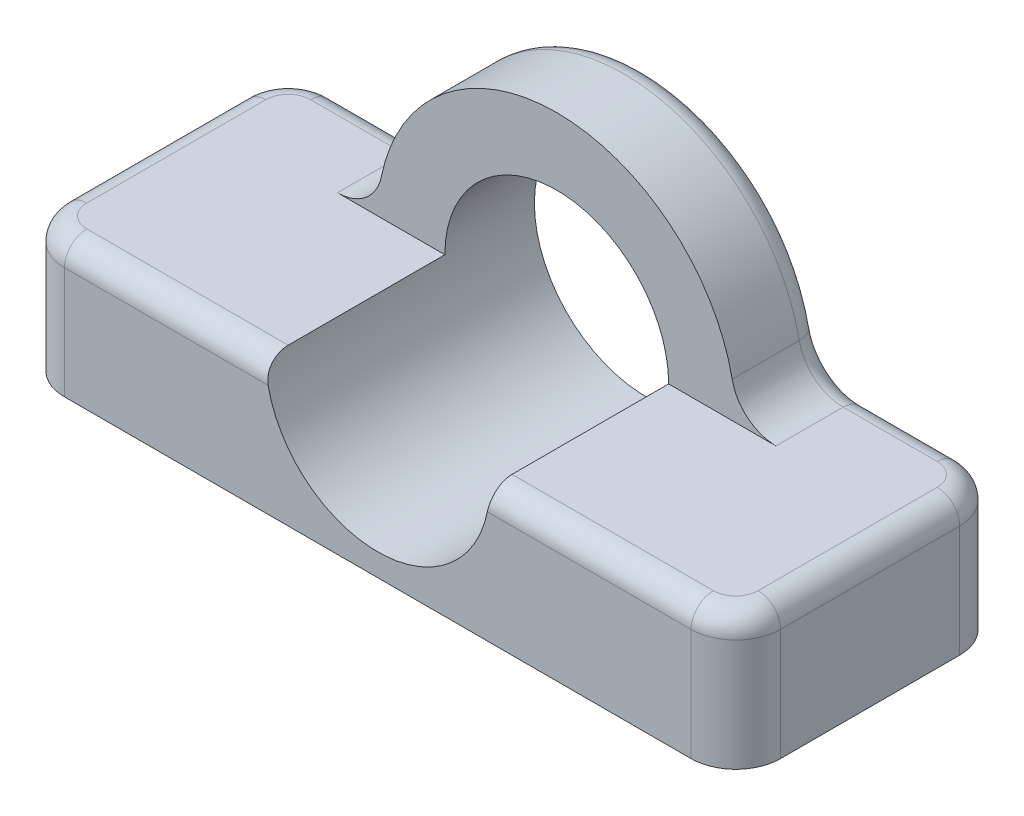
ISO-10303-21;
HEADER;
FILE_DESCRIPTION(('STEP AP214'),'2;1');
FILE_NAME('part.step','',(''),(''),'','','');
FILE_SCHEMA(('AUTOMOTIVE_DESIGN { 1 0 10303 214 1 1 1 1 }'));
ENDSEC;
DATA;
#1=APPLICATION_CONTEXT('core data for automotive mechanical design processes');
#2=APPLICATION_PROTOCOL_DEFINITION('international standard','automotive_design',2000,#1);
#3=PRODUCT_CONTEXT('',#1,'mechanical');
#4=PRODUCT('Part','Part','',(#3));
#5=PRODUCT_RELATED_PRODUCT_CATEGORY('part','',(#4));
#6=PRODUCT_DEFINITION_FORMATION('','',#4);
#7=PRODUCT_DEFINITION_CONTEXT('part definition',#1,'design');
#8=PRODUCT_DEFINITION('design','',#6,#7);
#9=PRODUCT_DEFINITION_SHAPE('','',#8);
#10=(LENGTH_UNIT() NAMED_UNIT(*) SI_UNIT(.MILLI.,.METRE.));
#11=(NAMED_UNIT(*) PLANE_ANGLE_UNIT() SI_UNIT($,.RADIAN.));
#12=(NAMED_UNIT(*) SI_UNIT($,.STERADIAN.) SOLID_ANGLE_UNIT());
#13=UNCERTAINTY_MEASURE_WITH_UNIT(LENGTH_MEASURE(1.E-05),#10,'distance_accuracy_value','');
#14=(GEOMETRIC_REPRESENTATION_CONTEXT(3) GLOBAL_UNCERTAINTY_ASSIGNED_CONTEXT((#13)) GLOBAL_UNIT_ASSIGNED_CONTEXT((#10,
#11,#12)) REPRESENTATION_CONTEXT('',''));
#15=CARTESIAN_POINT('',(0.,0.,0.));
#16=DIRECTION('',(0.,0.,1.));
#17=DIRECTION('',(1.,0.,0.));
#18=AXIS2_PLACEMENT_3D('',#15,#16,#17);
#19=CARTESIAN_POINT('',(0.,19.05,-38.1));
#20=DIRECTION('',(0.,-1.,0.));
#21=DIRECTION('',(0.,0.,-1.));
#22=AXIS2_PLACEMENT_3D('',#19,#20,#21);
#23=PLANE('',#22);
#24=DIRECTION('',(0.,0.,-1.));
#25=VECTOR('',#24,1.);
#26=CARTESIAN_POINT('',(19.6914802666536,19.05,-38.1));
#27=LINE('',#26,#25);
#28=CARTESIAN_POINT('',(19.6914802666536,19.05,-25.4));
#29=VERTEX_POINT('',#28);
#30=CARTESIAN_POINT('',(19.6914802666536,19.05,-34.925));
#31=VERTEX_POINT('',#30);
#32=EDGE_CURVE('E219',#29,#31,#27,.T.);
#33=ORIENTED_EDGE('',*,*,#32,.T.);
#34=DIRECTION('',(-1.,0.,0.));
#35=VECTOR('',#34,1.);
#36=CARTESIAN_POINT('',(0.,19.05,-34.925));
#37=LINE('',#36,#35);
#38=CARTESIAN_POINT('',(6.35,19.05,-34.925));
#39=VERTEX_POINT('',#38);
#40=EDGE_CURVE('E538',#31,#39,#37,.T.);
#41=ORIENTED_EDGE('',*,*,#40,.T.);
#42=CARTESIAN_POINT('',(6.35,19.05,-31.75));
#43=DIRECTION('',(0.,-1.,0.));
#44=DIRECTION('',(0.,0.,-1.));
#45=AXIS2_PLACEMENT_3D('',#42,#43,#44);
#46=CIRCLE('',#45,3.175);
#47=CARTESIAN_POINT('',(3.175,19.05,-31.75));
#48=VERTEX_POINT('',#47);
#49=EDGE_CURVE('E536',#39,#48,#46,.F.);
#50=ORIENTED_EDGE('',*,*,#49,.T.);
#51=DIRECTION('',(0.,0.,1.));
#52=VECTOR('',#51,1.);
#53=CARTESIAN_POINT('',(3.175,19.05,-38.1));
#54=LINE('',#53,#52);
#55=CARTESIAN_POINT('',(3.175,19.05,-6.35));
#56=VERTEX_POINT('',#55);
#57=EDGE_CURVE('E534',#48,#56,#54,.T.);
#58=ORIENTED_EDGE('',*,*,#57,.T.);
#59=CARTESIAN_POINT('',(6.35,19.05,-6.35));
#60=DIRECTION('',(0.,-1.,0.));
#61=DIRECTION('',(0.,0.,-1.));
#62=AXIS2_PLACEMENT_3D('',#59,#60,#61);
#63=CIRCLE('',#62,3.175);
#64=CARTESIAN_POINT('',(6.35,19.05,-3.175));
#65=VERTEX_POINT('',#64);
#66=EDGE_CURVE('E532',#56,#65,#63,.F.);
#67=ORIENTED_EDGE('',*,*,#66,.T.);
#68=DIRECTION('',(1.,0.,0.));
#69=VECTOR('',#68,1.);
#70=CARTESIAN_POINT('',(0.,19.05,-3.175));
#71=LINE('',#70,#69);
#72=CARTESIAN_POINT('',(34.925,19.05,-3.175));
#73=VERTEX_POINT('',#72);
#74=EDGE_CURVE('E176',#65,#73,#71,.T.);
#75=ORIENTED_EDGE('',*,*,#74,.T.);
#76=DIRECTION('',(0.,0.,-1.));
#77=VECTOR('',#76,1.);
#78=CARTESIAN_POINT('',(34.925,19.05,0.));
#79=LINE('',#78,#77);
#80=CARTESIAN_POINT('',(34.925,19.05,-25.4));
#81=VERTEX_POINT('',#80);
#82=EDGE_CURVE('E169',#73,#81,#79,.T.);
#83=ORIENTED_EDGE('',*,*,#82,.T.);
#84=DIRECTION('',(-1.,0.,0.));
#85=VECTOR('',#84,1.);
#86=CARTESIAN_POINT('',(25.4,19.05,-25.4));
#87=LINE('',#86,#85);
#88=EDGE_CURVE('E173',#81,#29,#87,.T.);
#89=ORIENTED_EDGE('',*,*,#88,.T.);
#90=EDGE_LOOP('',(#33,#41,#50,#58,#67,#75,#83,#89));
#91=FACE_BOUND('',#90,.T.);
#92=ADVANCED_FACE('F28',(#91),#23,.F.);
#93=CARTESIAN_POINT('',(0.,19.05,0.));
#94=DIRECTION('',(1.,0.,0.));
#95=DIRECTION('',(0.,0.,-1.));
#96=AXIS2_PLACEMENT_3D('',#93,#94,#95);
#97=PLANE('',#96);
#98=DIRECTION('',(0.,-1.,0.));
#99=VECTOR('',#98,1.);
#100=CARTESIAN_POINT('',(0.,19.05,-6.35));
#101=LINE('',#100,#99);
#102=CARTESIAN_POINT('',(0.,0.,-6.35));
#103=VERTEX_POINT('',#102);
#104=CARTESIAN_POINT('',(0.,15.875,-6.35));
#105=VERTEX_POINT('',#104);
#106=EDGE_CURVE('E248',#103,#105,#101,.F.);
#107=ORIENTED_EDGE('',*,*,#106,.T.);
#108=DIRECTION('',(0.,0.,1.));
#109=VECTOR('',#108,1.);
#110=CARTESIAN_POINT('',(0.,15.875,0.));
#111=LINE('',#110,#109);
#112=CARTESIAN_POINT('',(0.,15.875,-31.75));
#113=VERTEX_POINT('',#112);
#114=EDGE_CURVE('E36',#105,#113,#111,.F.);
#115=ORIENTED_EDGE('',*,*,#114,.T.);
#116=DIRECTION('',(0.,-1.,0.));
#117=VECTOR('',#116,1.);
#118=CARTESIAN_POINT('',(0.,19.05,-31.75));
#119=LINE('',#118,#117);
#120=CARTESIAN_POINT('',(0.,0.,-31.75));
#121=VERTEX_POINT('',#120);
#122=EDGE_CURVE('E250',#113,#121,#119,.T.);
#123=ORIENTED_EDGE('',*,*,#122,.T.);
#124=DIRECTION('',(0.,0.,1.));
#125=VECTOR('',#124,1.);
#126=CARTESIAN_POINT('',(0.,0.,0.));
#127=LINE('',#126,#125);
#128=EDGE_CURVE('E199',#121,#103,#127,.T.);
#129=ORIENTED_EDGE('',*,*,#128,.T.);
#130=EDGE_LOOP('',(#107,#115,#123,#129));
#131=FACE_BOUND('',#130,.T.);
#132=ADVANCED_FACE('F30',(#131),#97,.F.);
#133=CARTESIAN_POINT('',(0.,19.05,0.));
#134=DIRECTION('',(0.,0.,-1.));
#135=DIRECTION('',(-1.,0.,0.));
#136=AXIS2_PLACEMENT_3D('',#133,#134,#135);
#137=PLANE('',#136);
#138=DIRECTION('',(0.,-1.,0.));
#139=VECTOR('',#138,1.);
#140=CARTESIAN_POINT('',(95.25,19.05,0.));
#141=LINE('',#140,#139);
#142=CARTESIAN_POINT('',(95.25,0.,0.));
#143=VERTEX_POINT('',#142);
#144=CARTESIAN_POINT('',(95.25,15.875,0.));
#145=VERTEX_POINT('',#144);
#146=EDGE_CURVE('E240',#143,#145,#141,.F.);
#147=ORIENTED_EDGE('',*,*,#146,.T.);
#148=DIRECTION('',(1.,0.,0.));
#149=VECTOR('',#148,1.);
#150=CARTESIAN_POINT('',(0.,15.875,0.));
#151=LINE('',#150,#149);
#152=CARTESIAN_POINT('',(66.3542598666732,15.875,0.));
#153=VERTEX_POINT('',#152);
#154=EDGE_CURVE('E265',#145,#153,#151,.F.);
#155=ORIENTED_EDGE('',*,*,#154,.T.);
#156=CARTESIAN_POINT('',(50.8,19.05,0.));
#157=DIRECTION('',(0.,0.,-1.));
#158=DIRECTION('',(-1.,0.,0.));
#159=AXIS2_PLACEMENT_3D('',#156,#157,#158);
#160=CIRCLE('',#159,15.875);
#161=CARTESIAN_POINT('',(35.2457401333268,15.875,0.));
#162=VERTEX_POINT('',#161);
#163=EDGE_CURVE('E619',#153,#162,#160,.T.);
#164=ORIENTED_EDGE('',*,*,#163,.T.);
#165=DIRECTION('',(1.,0.,0.));
#166=VECTOR('',#165,1.);
#167=CARTESIAN_POINT('',(0.,15.875,0.));
#168=LINE('',#167,#166);
#169=CARTESIAN_POINT('',(6.35,15.875,0.));
#170=VERTEX_POINT('',#169);
#171=EDGE_CURVE('E263',#162,#170,#168,.F.);
#172=ORIENTED_EDGE('',*,*,#171,.T.);
#173=DIRECTION('',(0.,-1.,0.));
#174=VECTOR('',#173,1.);
#175=CARTESIAN_POINT('',(6.35,19.05,0.));
#176=LINE('',#175,#174);
#177=CARTESIAN_POINT('',(6.35,0.,0.));
#178=VERTEX_POINT('',#177);
#179=EDGE_CURVE('E238',#170,#178,#176,.T.);
#180=ORIENTED_EDGE('',*,*,#179,.T.);
#181=DIRECTION('',(1.,0.,0.));
#182=VECTOR('',#181,1.);
#183=CARTESIAN_POINT('',(0.,0.,0.));
#184=LINE('',#183,#182);
#185=EDGE_CURVE('E205',#178,#143,#184,.T.);
#186=ORIENTED_EDGE('',*,*,#185,.T.);
#187=EDGE_LOOP('',(#147,#155,#164,#172,#180,#186));
#188=FACE_BOUND('',#187,.T.);
#189=ADVANCED_FACE('F320',(#188),#137,.F.);
#190=CARTESIAN_POINT('',(101.6,19.05,0.));
#191=DIRECTION('',(-1.,0.,0.));
#192=DIRECTION('',(0.,0.,1.));
#193=AXIS2_PLACEMENT_3D('',#190,#191,#192);
#194=PLANE('',#193);
#195=DIRECTION('',(0.,-1.,0.));
#196=VECTOR('',#195,1.);
#197=CARTESIAN_POINT('',(101.6,19.05,-31.75));
#198=LINE('',#197,#196);
#199=CARTESIAN_POINT('',(101.6,0.,-31.75));
#200=VERTEX_POINT('',#199);
#201=CARTESIAN_POINT('',(101.6,15.875,-31.75));
#202=VERTEX_POINT('',#201);
#203=EDGE_CURVE('E190',#200,#202,#198,.F.);
#204=ORIENTED_EDGE('',*,*,#203,.T.);
#205=DIRECTION('',(0.,0.,-1.));
#206=VECTOR('',#205,1.);
#207=CARTESIAN_POINT('',(101.6,15.875,0.));
#208=LINE('',#207,#206);
#209=CARTESIAN_POINT('',(101.6,15.875,-6.35));
#210=VERTEX_POINT('',#209);
#211=EDGE_CURVE('E507',#202,#210,#208,.F.);
#212=ORIENTED_EDGE('',*,*,#211,.T.);
#213=DIRECTION('',(0.,-1.,0.));
#214=VECTOR('',#213,1.);
#215=CARTESIAN_POINT('',(101.6,19.05,-6.35));
#216=LINE('',#215,#214);
#217=CARTESIAN_POINT('',(101.6,0.,-6.35));
#218=VERTEX_POINT('',#217);
#219=EDGE_CURVE('E228',#210,#218,#216,.T.);
#220=ORIENTED_EDGE('',*,*,#219,.T.);
#221=DIRECTION('',(0.,0.,-1.));
#222=VECTOR('',#221,1.);
#223=CARTESIAN_POINT('',(101.6,0.,0.));
#224=LINE('',#223,#222);
#225=EDGE_CURVE('E208',#218,#200,#224,.T.);
#226=ORIENTED_EDGE('',*,*,#225,.T.);
#227=EDGE_LOOP('',(#204,#212,#220,#226));
#228=FACE_BOUND('',#227,.T.);
#229=ADVANCED_FACE('F317',(#228),#194,.F.);
#230=CARTESIAN_POINT('',(0.,19.05,-38.1));
#231=DIRECTION('',(0.,0.,1.));
#232=DIRECTION('',(1.,0.,0.));
#233=AXIS2_PLACEMENT_3D('',#230,#231,#232);
#234=PLANE('',#233);
#235=CARTESIAN_POINT('',(50.8,19.05,-38.1));
#236=DIRECTION('',(0.,0.,-1.));
#237=DIRECTION('',(-1.,0.,0.));
#238=AXIS2_PLACEMENT_3D('',#235,#236,#237);
#239=CIRCLE('',#238,15.875);
#240=CARTESIAN_POINT('',(34.925,19.05,-38.1));
#241=VERTEX_POINT('',#240);
#242=EDGE_CURVE('E616',#241,#241,#239,.T.);
#243=ORIENTED_EDGE('',*,*,#242,.F.);
#244=EDGE_LOOP('',(#243));
#245=FACE_BOUND('',#244,.T.);
#246=CARTESIAN_POINT('',(81.9085197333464,25.4,-38.1));
#247=DIRECTION('',(0.,0.,1.));
#248=DIRECTION('',(1.,0.,0.));
#249=AXIS2_PLACEMENT_3D('',#246,#247,#248);
#250=CIRCLE('',#249,9.525);
#251=CARTESIAN_POINT('',(72.5759638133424,23.495,-38.1));
#252=VERTEX_POINT('',#251);
#253=CARTESIAN_POINT('',(81.9085197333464,15.875,-38.1));
#254=VERTEX_POINT('',#253);
#255=EDGE_CURVE('E521',#252,#254,#250,.T.);
#256=ORIENTED_EDGE('',*,*,#255,.T.);
#257=DIRECTION('',(-1.,0.,0.));
#258=VECTOR('',#257,1.);
#259=CARTESIAN_POINT('',(0.,15.875,-38.1));
#260=LINE('',#259,#258);
#261=CARTESIAN_POINT('',(95.25,15.875,-38.1));
#262=VERTEX_POINT('',#261);
#263=EDGE_CURVE('E523',#254,#262,#260,.F.);
#264=ORIENTED_EDGE('',*,*,#263,.T.);
#265=DIRECTION('',(0.,-1.,0.));
#266=VECTOR('',#265,1.);
#267=CARTESIAN_POINT('',(95.25,19.05,-38.1));
#268=LINE('',#267,#266);
#269=CARTESIAN_POINT('',(95.25,0.,-38.1));
#270=VERTEX_POINT('',#269);
#271=EDGE_CURVE('E246',#262,#270,#268,.T.);
#272=ORIENTED_EDGE('',*,*,#271,.T.);
#273=DIRECTION('',(-1.,0.,0.));
#274=VECTOR('',#273,1.);
#275=CARTESIAN_POINT('',(0.,0.,-38.1));
#276=LINE('',#275,#274);
#277=CARTESIAN_POINT('',(6.35,0.,-38.1));
#278=VERTEX_POINT('',#277);
#279=EDGE_CURVE('E211',#270,#278,#276,.T.);
#280=ORIENTED_EDGE('',*,*,#279,.T.);
#281=DIRECTION('',(0.,-1.,0.));
#282=VECTOR('',#281,1.);
#283=CARTESIAN_POINT('',(6.35,19.05,-38.1));
#284=LINE('',#283,#282);
#285=CARTESIAN_POINT('',(6.35,15.875,-38.1));
#286=VERTEX_POINT('',#285);
#287=EDGE_CURVE('E243',#278,#286,#284,.F.);
#288=ORIENTED_EDGE('',*,*,#287,.T.);
#289=DIRECTION('',(-1.,0.,0.));
#290=VECTOR('',#289,1.);
#291=CARTESIAN_POINT('',(0.,15.875,-38.1));
#292=LINE('',#291,#290);
#293=CARTESIAN_POINT('',(19.6914802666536,15.875,-38.1));
#294=VERTEX_POINT('',#293);
#295=EDGE_CURVE('E515',#286,#294,#292,.F.);
#296=ORIENTED_EDGE('',*,*,#295,.T.);
#297=CARTESIAN_POINT('',(19.6914802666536,25.4,-38.1));
#298=DIRECTION('',(0.,0.,1.));
#299=DIRECTION('',(1.,0.,0.));
#300=AXIS2_PLACEMENT_3D('',#297,#298,#299);
#301=CIRCLE('',#300,9.525);
#302=CARTESIAN_POINT('',(29.0240361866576,23.495,-38.1));
#303=VERTEX_POINT('',#302);
#304=EDGE_CURVE('E517',#294,#303,#301,.T.);
#305=ORIENTED_EDGE('',*,*,#304,.T.);
#306=CARTESIAN_POINT('',(50.8,19.05,-38.1));
#307=DIRECTION('',(0.,0.,1.));
#308=DIRECTION('',(1.,0.,0.));
#309=AXIS2_PLACEMENT_3D('',#306,#307,#308);
#310=CIRCLE('',#309,22.225);
#311=EDGE_CURVE('E519',#303,#252,#310,.F.);
#312=ORIENTED_EDGE('',*,*,#311,.T.);
#313=EDGE_LOOP('',(#256,#264,#272,#280,#288,#296,#305,#312));
#314=FACE_BOUND('',#313,.T.);
#315=ADVANCED_FACE('F313',(#245,#314),#234,.F.);
#316=DIRECTION('',(0.,0.,-1.));
#317=VECTOR('',#316,1.);
#318=CARTESIAN_POINT('',(66.675,19.05,0.));
#319=LINE('',#318,#317);
#320=CARTESIAN_POINT('',(66.675,19.05,-25.4));
#321=VERTEX_POINT('',#320);
#322=CARTESIAN_POINT('',(66.675,19.05,-3.175));
#323=VERTEX_POINT('',#322);
#324=EDGE_CURVE('E180',#321,#323,#319,.F.);
#325=ORIENTED_EDGE('',*,*,#324,.T.);
#326=DIRECTION('',(1.,0.,0.));
#327=VECTOR('',#326,1.);
#328=CARTESIAN_POINT('',(0.,19.05,-3.175));
#329=LINE('',#328,#327);
#330=CARTESIAN_POINT('',(95.25,19.05,-3.175));
#331=VERTEX_POINT('',#330);
#332=EDGE_CURVE('E260',#323,#331,#329,.T.);
#333=ORIENTED_EDGE('',*,*,#332,.T.);
#334=CARTESIAN_POINT('',(95.25,19.05,-6.35));
#335=DIRECTION('',(0.,-1.,0.));
#336=DIRECTION('',(0.,0.,-1.));
#337=AXIS2_PLACEMENT_3D('',#334,#335,#336);
#338=CIRCLE('',#337,3.175);
#339=CARTESIAN_POINT('',(98.425,19.05,-6.35));
#340=VERTEX_POINT('',#339);
#341=EDGE_CURVE('E258',#331,#340,#338,.F.);
#342=ORIENTED_EDGE('',*,*,#341,.T.);
#343=DIRECTION('',(0.,0.,-1.));
#344=VECTOR('',#343,1.);
#345=CARTESIAN_POINT('',(98.425,19.05,-38.1));
#346=LINE('',#345,#344);
#347=CARTESIAN_POINT('',(98.425,19.05,-31.75));
#348=VERTEX_POINT('',#347);
#349=EDGE_CURVE('E256',#340,#348,#346,.T.);
#350=ORIENTED_EDGE('',*,*,#349,.T.);
#351=CARTESIAN_POINT('',(95.25,19.05,-31.75));
#352=DIRECTION('',(0.,-1.,0.));
#353=DIRECTION('',(0.,0.,-1.));
#354=AXIS2_PLACEMENT_3D('',#351,#352,#353);
#355=CIRCLE('',#354,3.175);
#356=CARTESIAN_POINT('',(95.25,19.05,-34.925));
#357=VERTEX_POINT('',#356);
#358=EDGE_CURVE('E254',#348,#357,#355,.F.);
#359=ORIENTED_EDGE('',*,*,#358,.T.);
#360=DIRECTION('',(-1.,0.,0.));
#361=VECTOR('',#360,1.);
#362=CARTESIAN_POINT('',(0.,19.05,-34.925));
#363=LINE('',#362,#361);
#364=CARTESIAN_POINT('',(81.9085197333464,19.05,-34.925));
#365=VERTEX_POINT('',#364);
#366=EDGE_CURVE('E252',#357,#365,#363,.T.);
#367=ORIENTED_EDGE('',*,*,#366,.T.);
#368=DIRECTION('',(0.,0.,-1.));
#369=VECTOR('',#368,1.);
#370=CARTESIAN_POINT('',(81.9085197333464,19.05,-38.1));
#371=LINE('',#370,#369);
#372=CARTESIAN_POINT('',(81.9085197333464,19.05,-25.4));
#373=VERTEX_POINT('',#372);
#374=EDGE_CURVE('E221',#365,#373,#371,.F.);
#375=ORIENTED_EDGE('',*,*,#374,.T.);
#376=EDGE_CURVE('E197',#373,#321,#87,.T.);
#377=ORIENTED_EDGE('',*,*,#376,.T.);
#378=EDGE_LOOP('',(#325,#333,#342,#350,#359,#367,#375,#377));
#379=FACE_BOUND('',#378,.T.);
#380=ADVANCED_FACE('F309',(#379),#23,.F.);
#381=CARTESIAN_POINT('',(0.,0.,-38.1));
#382=DIRECTION('',(0.,-1.,0.));
#383=DIRECTION('',(0.,0.,-1.));
#384=AXIS2_PLACEMENT_3D('',#381,#382,#383);
#385=PLANE('',#384);
#386=ORIENTED_EDGE('',*,*,#225,.F.);
#387=CARTESIAN_POINT('',(95.25,0.,-6.35));
#388=DIRECTION('',(0.,-1.,0.));
#389=DIRECTION('',(0.,0.,-1.));
#390=AXIS2_PLACEMENT_3D('',#387,#388,#389);
#391=CIRCLE('',#390,6.35);
#392=EDGE_CURVE('E236',#218,#143,#391,.T.);
#393=ORIENTED_EDGE('',*,*,#392,.T.);
#394=ORIENTED_EDGE('',*,*,#185,.F.);
#395=CARTESIAN_POINT('',(6.35,0.,-6.35));
#396=DIRECTION('',(0.,-1.,0.));
#397=DIRECTION('',(0.,0.,-1.));
#398=AXIS2_PLACEMENT_3D('',#395,#396,#397);
#399=CIRCLE('',#398,6.35);
#400=EDGE_CURVE('E230',#178,#103,#399,.T.);
#401=ORIENTED_EDGE('',*,*,#400,.T.);
#402=ORIENTED_EDGE('',*,*,#128,.F.);
#403=CARTESIAN_POINT('',(6.35,0.,-31.75));
#404=DIRECTION('',(0.,-1.,0.));
#405=DIRECTION('',(0.,0.,-1.));
#406=AXIS2_PLACEMENT_3D('',#403,#404,#405);
#407=CIRCLE('',#406,6.35);
#408=EDGE_CURVE('E232',#121,#278,#407,.T.);
#409=ORIENTED_EDGE('',*,*,#408,.T.);
#410=ORIENTED_EDGE('',*,*,#279,.F.);
#411=CARTESIAN_POINT('',(95.25,0.,-31.75));
#412=DIRECTION('',(0.,-1.,0.));
#413=DIRECTION('',(0.,0.,-1.));
#414=AXIS2_PLACEMENT_3D('',#411,#412,#413);
#415=CIRCLE('',#414,6.35);
#416=EDGE_CURVE('E234',#270,#200,#415,.T.);
#417=ORIENTED_EDGE('',*,*,#416,.T.);
#418=EDGE_LOOP('',(#386,#393,#394,#401,#402,#409,#410,#417));
#419=FACE_BOUND('',#418,.T.);
#420=ADVANCED_FACE('F305',(#419),#385,.T.);
#421=CARTESIAN_POINT('',(50.8,19.05,-25.4));
#422=DIRECTION('',(0.,0.,-1.));
#423=DIRECTION('',(-1.,0.,0.));
#424=AXIS2_PLACEMENT_3D('',#421,#422,#423);
#425=CYLINDRICAL_SURFACE('',#424,25.4);
#426=DIRECTION('',(0.,0.,-1.));
#427=VECTOR('',#426,1.);
#428=CARTESIAN_POINT('',(75.6868157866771,24.13,-25.4));
#429=LINE('',#428,#427);
#430=CARTESIAN_POINT('',(75.6868157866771,24.13,-25.4));
#431=VERTEX_POINT('',#430);
#432=CARTESIAN_POINT('',(75.6868157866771,24.13,-34.925));
#433=VERTEX_POINT('',#432);
#434=EDGE_CURVE('E216',#431,#433,#429,.T.);
#435=ORIENTED_EDGE('',*,*,#434,.T.);
#436=CARTESIAN_POINT('',(50.8,19.05,-34.925));
#437=DIRECTION('',(0.,0.,1.));
#438=DIRECTION('',(1.,0.,0.));
#439=AXIS2_PLACEMENT_3D('',#436,#437,#438);
#440=CIRCLE('',#439,25.4);
#441=CARTESIAN_POINT('',(25.9131842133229,24.13,-34.925));
#442=VERTEX_POINT('',#441);
#443=EDGE_CURVE('E527',#433,#442,#440,.T.);
#444=ORIENTED_EDGE('',*,*,#443,.T.);
#445=DIRECTION('',(0.,0.,-1.));
#446=VECTOR('',#445,1.);
#447=CARTESIAN_POINT('',(25.9131842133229,24.13,-25.4));
#448=LINE('',#447,#446);
#449=CARTESIAN_POINT('',(25.9131842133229,24.13,-25.4));
#450=VERTEX_POINT('',#449);
#451=EDGE_CURVE('E214',#442,#450,#448,.F.);
#452=ORIENTED_EDGE('',*,*,#451,.T.);
#453=CARTESIAN_POINT('',(50.8,19.05,-25.4));
#454=DIRECTION('',(0.,0.,-1.));
#455=DIRECTION('',(1.,0.,0.));
#456=AXIS2_PLACEMENT_3D('',#453,#454,#455);
#457=CIRCLE('',#456,25.4);
#458=EDGE_CURVE('E179',#450,#431,#457,.T.);
#459=ORIENTED_EDGE('',*,*,#458,.T.);
#460=EDGE_LOOP('',(#435,#444,#452,#459));
#461=FACE_BOUND('',#460,.T.);
#462=ADVANCED_FACE('F302',(#461),#425,.T.);
#463=CARTESIAN_POINT('',(50.8,19.05,-25.4));
#464=DIRECTION('',(0.,0.,1.));
#465=DIRECTION('',(1.,0.,0.));
#466=AXIS2_PLACEMENT_3D('',#463,#464,#465);
#467=PLANE('',#466);
#468=CARTESIAN_POINT('',(50.8,19.05,-25.4));
#469=DIRECTION('',(0.,0.,1.));
#470=DIRECTION('',(1.,0.,0.));
#471=AXIS2_PLACEMENT_3D('',#468,#469,#470);
#472=CIRCLE('',#471,15.875);
#473=EDGE_CURVE('E183',#321,#81,#472,.T.);
#474=ORIENTED_EDGE('',*,*,#473,.F.);
#475=ORIENTED_EDGE('',*,*,#376,.F.);
#476=CARTESIAN_POINT('',(81.9085197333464,25.4,-25.4));
#477=DIRECTION('',(0.,0.,1.));
#478=DIRECTION('',(1.,0.,0.));
#479=AXIS2_PLACEMENT_3D('',#476,#477,#478);
#480=CIRCLE('',#479,6.35);
#481=EDGE_CURVE('E223',#373,#431,#480,.F.);
#482=ORIENTED_EDGE('',*,*,#481,.T.);
#483=ORIENTED_EDGE('',*,*,#458,.F.);
#484=CARTESIAN_POINT('',(19.6914802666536,25.4,-25.4));
#485=DIRECTION('',(0.,0.,1.));
#486=DIRECTION('',(1.,0.,0.));
#487=AXIS2_PLACEMENT_3D('',#484,#485,#486);
#488=CIRCLE('',#487,6.35);
#489=EDGE_CURVE('E191',#450,#29,#488,.F.);
#490=ORIENTED_EDGE('',*,*,#489,.T.);
#491=ORIENTED_EDGE('',*,*,#88,.F.);
#492=EDGE_LOOP('',(#474,#475,#482,#483,#490,#491));
#493=FACE_BOUND('',#492,.T.);
#494=ADVANCED_FACE('F193',(#493),#467,.T.);
#495=CARTESIAN_POINT('',(81.9085197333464,25.4,-25.4));
#496=DIRECTION('',(0.,0.,-1.));
#497=DIRECTION('',(-1.,0.,0.));
#498=AXIS2_PLACEMENT_3D('',#495,#496,#497);
#499=CYLINDRICAL_SURFACE('',#498,6.35);
#500=ORIENTED_EDGE('',*,*,#374,.F.);
#501=CARTESIAN_POINT('',(81.9085197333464,25.4,-34.925));
#502=DIRECTION('',(0.,0.,1.));
#503=DIRECTION('',(1.,0.,0.));
#504=AXIS2_PLACEMENT_3D('',#501,#502,#503);
#505=CIRCLE('',#504,6.35);
#506=EDGE_CURVE('E525',#365,#433,#505,.F.);
#507=ORIENTED_EDGE('',*,*,#506,.T.);
#508=ORIENTED_EDGE('',*,*,#434,.F.);
#509=ORIENTED_EDGE('',*,*,#481,.F.);
#510=EDGE_LOOP('',(#500,#507,#508,#509));
#511=FACE_BOUND('',#510,.T.);
#512=ADVANCED_FACE('F295',(#511),#499,.F.);
#513=CARTESIAN_POINT('',(19.6914802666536,25.4,-25.4));
#514=DIRECTION('',(0.,0.,-1.));
#515=DIRECTION('',(-1.,0.,0.));
#516=AXIS2_PLACEMENT_3D('',#513,#514,#515);
#517=CYLINDRICAL_SURFACE('',#516,6.35);
#518=ORIENTED_EDGE('',*,*,#451,.F.);
#519=CARTESIAN_POINT('',(19.6914802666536,25.4,-34.925));
#520=DIRECTION('',(0.,0.,1.));
#521=DIRECTION('',(1.,0.,0.));
#522=AXIS2_PLACEMENT_3D('',#519,#520,#521);
#523=CIRCLE('',#522,6.35);
#524=EDGE_CURVE('E529',#442,#31,#523,.F.);
#525=ORIENTED_EDGE('',*,*,#524,.T.);
#526=ORIENTED_EDGE('',*,*,#32,.F.);
#527=ORIENTED_EDGE('',*,*,#489,.F.);
#528=EDGE_LOOP('',(#518,#525,#526,#527));
#529=FACE_BOUND('',#528,.T.);
#530=ADVANCED_FACE('F289',(#529),#517,.F.);
#531=CARTESIAN_POINT('',(50.8,19.05,0.));
#532=DIRECTION('',(0.,0.,-1.));
#533=DIRECTION('',(-1.,0.,0.));
#534=AXIS2_PLACEMENT_3D('',#531,#532,#533);
#535=CYLINDRICAL_SURFACE('',#534,15.875);
#536=ORIENTED_EDGE('',*,*,#242,.T.);
#537=EDGE_LOOP('',(#536));
#538=FACE_BOUND('',#537,.T.);
#539=ORIENTED_EDGE('',*,*,#163,.F.);
#540=CARTESIAN_POINT('',(66.3542598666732,15.875,0.));
#541=CARTESIAN_POINT('',(66.3720931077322,15.962329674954,8.87743763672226E-06));
#542=CARTESIAN_POINT('',(66.3891776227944,16.0498139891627,-0.00360318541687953));
#543=CARTESIAN_POINT('',(66.4217766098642,16.2244812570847,-0.0180783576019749));
#544=CARTESIAN_POINT('',(66.437290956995,16.3116641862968,-0.0289420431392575));
#545=CARTESIAN_POINT('',(66.4666673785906,16.4850639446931,-0.0579229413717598));
#546=CARTESIAN_POINT('',(66.4805302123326,16.5712812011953,-0.0760368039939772));
#547=CARTESIAN_POINT('',(66.506584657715,16.7421208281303,-0.119430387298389));
#548=CARTESIAN_POINT('',(66.5187763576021,16.8267432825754,-0.144709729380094));
#549=CARTESIAN_POINT('',(66.5528748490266,17.0774659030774,-0.231210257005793));
#550=CARTESIAN_POINT('',(66.5722980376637,17.240379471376,-0.303086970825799));
#551=CARTESIAN_POINT('',(66.6049661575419,17.5522218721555,-0.473307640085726));
#552=CARTESIAN_POINT('',(66.6182134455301,17.7011560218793,-0.571641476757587));
#553=CARTESIAN_POINT('',(66.6394563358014,17.9792477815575,-0.790931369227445));
#554=CARTESIAN_POINT('',(66.647504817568,18.108593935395,-0.911643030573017));
#555=CARTESIAN_POINT('',(66.6598085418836,18.3455690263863,-1.17299053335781));
#556=CARTESIAN_POINT('',(66.6640627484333,18.4531920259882,-1.31363180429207));
#557=CARTESIAN_POINT('',(66.6700979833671,18.6440402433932,-1.61151670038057));
#558=CARTESIAN_POINT('',(66.6718678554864,18.7271540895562,-1.76883182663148));
#559=CARTESIAN_POINT('',(66.6740856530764,18.8659575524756,-2.0950977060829));
#560=CARTESIAN_POINT('',(66.6745342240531,18.9216605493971,-2.26404273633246));
#561=CARTESIAN_POINT('',(66.6749201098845,18.9918168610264,-2.55729200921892));
#562=CARTESIAN_POINT('',(66.6749699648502,19.0136166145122,-2.67989145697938));
#563=CARTESIAN_POINT('',(66.6750000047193,19.0427104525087,-2.92664444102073));
#564=CARTESIAN_POINT('',(66.6749802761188,19.0500225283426,-3.05079585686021));
#565=CARTESIAN_POINT('',(66.675,19.05,-3.175));
#566=B_SPLINE_CURVE_WITH_KNOTS('',3,(#540,#541,#542,#543,#544,#545,#546,#547,#548,#549,#550,
#551,#552,#553,#554,#555,#556,#557,#558,#559,#560,#561,#562,#563,#564,#565),.UNSPECIFIED.,.F.,
.F.,(4,2,2,2,2,2,2,2,2,2,2,2,4),(0.,0.267320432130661,0.534662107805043,0.801880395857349,
1.0690845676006,1.60362027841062,2.13795184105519,2.66675912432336,3.19571075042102,
3.72703019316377,4.25809002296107,4.63084898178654,5.00314474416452),.UNSPECIFIED.);
#567=EDGE_CURVE('E274',#153,#323,#566,.T.);
#568=ORIENTED_EDGE('',*,*,#567,.T.);
#569=ORIENTED_EDGE('',*,*,#324,.F.);
#570=ORIENTED_EDGE('',*,*,#473,.T.);
#571=ORIENTED_EDGE('',*,*,#82,.F.);
#572=CARTESIAN_POINT('',(34.925,19.05,-3.175));
#573=CARTESIAN_POINT('',(34.9250056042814,19.0500085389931,-3.08573332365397));
#574=CARTESIAN_POINT('',(34.9250001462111,19.0462353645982,-2.99647070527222));
#575=CARTESIAN_POINT('',(34.9250078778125,19.0311916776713,-2.81858347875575));
#576=CARTESIAN_POINT('',(34.925021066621,19.019921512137,-2.72995884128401));
#577=CARTESIAN_POINT('',(34.9251068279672,18.9899602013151,-2.55402946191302));
#578=CARTESIAN_POINT('',(34.9251793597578,18.9712741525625,-2.46672385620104));
#579=CARTESIAN_POINT('',(34.9254638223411,18.9266326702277,-2.29401792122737));
#580=CARTESIAN_POINT('',(34.9256757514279,18.9006773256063,-2.20861756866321));
#581=CARTESIAN_POINT('',(34.9266707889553,18.8121156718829,-1.95609445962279));
#582=CARTESIAN_POINT('',(34.9278130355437,18.7388021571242,-1.79258198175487));
#583=CARTESIAN_POINT('',(34.9321508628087,18.5658310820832,-1.48031718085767));
#584=CARTESIAN_POINT('',(34.9353460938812,18.4661780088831,-1.3315623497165));
#585=CARTESIAN_POINT('',(34.9451066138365,18.2435631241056,-1.05315480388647));
#586=CARTESIAN_POINT('',(34.9516662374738,18.1206407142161,-0.9234704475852));
#587=CARTESIAN_POINT('',(34.9694830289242,17.8549967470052,-0.686646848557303));
#588=CARTESIAN_POINT('',(34.9807403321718,17.7122746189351,-0.579508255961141));
#589=CARTESIAN_POINT('',(35.0089788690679,17.4123852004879,-0.391442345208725));
#590=CARTESIAN_POINT('',(35.0259206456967,17.2553227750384,-0.310341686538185));
#591=CARTESIAN_POINT('',(35.0662566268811,16.9306502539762,-0.175484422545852));
#592=CARTESIAN_POINT('',(35.0896488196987,16.7630434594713,-0.121719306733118));
#593=CARTESIAN_POINT('',(35.1348417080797,16.4745837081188,-0.0547644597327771));
#594=CARTESIAN_POINT('',(35.1549394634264,16.3551162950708,-0.0341932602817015));
#595=CARTESIAN_POINT('',(35.1981279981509,16.1153449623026,-0.00681034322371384));
#596=CARTESIAN_POINT('',(35.221214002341,15.9950426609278,2.30452582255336E-05));
#597=CARTESIAN_POINT('',(35.2457401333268,15.875,0.));
#598=B_SPLINE_CURVE_WITH_KNOTS('',3,(#572,#573,#574,#575,#576,#577,#578,#579,#580,#581,#582,
#583,#584,#585,#586,#587,#588,#589,#590,#591,#592,#593,#594,#595,#596,#597),.UNSPECIFIED.,.F.,
.F.,(4,2,2,2,2,2,2,2,2,2,2,2,4),(0.,0.267712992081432,0.535413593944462,0.802930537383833,
1.07044420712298,1.60526817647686,2.14000109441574,2.67383652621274,3.20768734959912,
3.73790673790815,4.26796094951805,4.63583577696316,5.00312983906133),.UNSPECIFIED.);
#599=EDGE_CURVE('E267',#73,#162,#598,.T.);
#600=ORIENTED_EDGE('',*,*,#599,.T.);
#601=EDGE_LOOP('',(#539,#568,#569,#570,#571,#600));
#602=FACE_BOUND('',#601,.T.);
#603=ADVANCED_FACE('F185',(#538,#602),#535,.F.);
#604=CARTESIAN_POINT('',(95.25,19.05,-6.35));
#605=DIRECTION('',(0.,-1.,0.));
#606=DIRECTION('',(0.,0.,-1.));
#607=AXIS2_PLACEMENT_3D('',#604,#605,#606);
#608=CYLINDRICAL_SURFACE('',#607,6.35);
#609=ORIENTED_EDGE('',*,*,#219,.F.);
#610=CARTESIAN_POINT('',(95.25,15.875,-6.35));
#611=DIRECTION('',(0.,-1.,0.));
#612=DIRECTION('',(0.,0.,-1.));
#613=AXIS2_PLACEMENT_3D('',#610,#611,#612);
#614=CIRCLE('',#613,6.35);
#615=EDGE_CURVE('E506',#210,#145,#614,.T.);
#616=ORIENTED_EDGE('',*,*,#615,.T.);
#617=ORIENTED_EDGE('',*,*,#146,.F.);
#618=ORIENTED_EDGE('',*,*,#392,.F.);
#619=EDGE_LOOP('',(#609,#616,#617,#618));
#620=FACE_BOUND('',#619,.T.);
#621=ADVANCED_FACE('F288',(#620),#608,.T.);
#622=CARTESIAN_POINT('',(95.25,19.05,-31.75));
#623=DIRECTION('',(0.,-1.,0.));
#624=DIRECTION('',(0.,0.,-1.));
#625=AXIS2_PLACEMENT_3D('',#622,#623,#624);
#626=CYLINDRICAL_SURFACE('',#625,6.35);
#627=ORIENTED_EDGE('',*,*,#271,.F.);
#628=CARTESIAN_POINT('',(95.25,15.875,-31.75));
#629=DIRECTION('',(0.,-1.,0.));
#630=DIRECTION('',(0.,0.,-1.));
#631=AXIS2_PLACEMENT_3D('',#628,#629,#630);
#632=CIRCLE('',#631,6.35);
#633=EDGE_CURVE('E511',#262,#202,#632,.T.);
#634=ORIENTED_EDGE('',*,*,#633,.T.);
#635=ORIENTED_EDGE('',*,*,#203,.F.);
#636=ORIENTED_EDGE('',*,*,#416,.F.);
#637=EDGE_LOOP('',(#627,#634,#635,#636));
#638=FACE_BOUND('',#637,.T.);
#639=ADVANCED_FACE('F378',(#638),#626,.T.);
#640=CARTESIAN_POINT('',(6.35,19.05,-31.75));
#641=DIRECTION('',(0.,-1.,0.));
#642=DIRECTION('',(0.,0.,-1.));
#643=AXIS2_PLACEMENT_3D('',#640,#641,#642);
#644=CYLINDRICAL_SURFACE('',#643,6.35);
#645=ORIENTED_EDGE('',*,*,#122,.F.);
#646=CARTESIAN_POINT('',(6.35,15.875,-31.75));
#647=DIRECTION('',(0.,-1.,0.));
#648=DIRECTION('',(0.,0.,-1.));
#649=AXIS2_PLACEMENT_3D('',#646,#647,#648);
#650=CIRCLE('',#649,6.35);
#651=EDGE_CURVE('E540',#113,#286,#650,.T.);
#652=ORIENTED_EDGE('',*,*,#651,.T.);
#653=ORIENTED_EDGE('',*,*,#287,.F.);
#654=ORIENTED_EDGE('',*,*,#408,.F.);
#655=EDGE_LOOP('',(#645,#652,#653,#654));
#656=FACE_BOUND('',#655,.T.);
#657=ADVANCED_FACE('F385',(#656),#644,.T.);
#658=CARTESIAN_POINT('',(6.35,19.05,-6.35));
#659=DIRECTION('',(0.,-1.,0.));
#660=DIRECTION('',(0.,0.,-1.));
#661=AXIS2_PLACEMENT_3D('',#658,#659,#660);
#662=CYLINDRICAL_SURFACE('',#661,6.35);
#663=ORIENTED_EDGE('',*,*,#179,.F.);
#664=CARTESIAN_POINT('',(6.35,15.875,-6.35));
#665=DIRECTION('',(0.,-1.,0.));
#666=DIRECTION('',(0.,0.,-1.));
#667=AXIS2_PLACEMENT_3D('',#664,#665,#666);
#668=CIRCLE('',#667,6.35);
#669=EDGE_CURVE('E11',#170,#105,#668,.T.);
#670=ORIENTED_EDGE('',*,*,#669,.T.);
#671=ORIENTED_EDGE('',*,*,#106,.F.);
#672=ORIENTED_EDGE('',*,*,#400,.F.);
#673=EDGE_LOOP('',(#663,#670,#671,#672));
#674=FACE_BOUND('',#673,.T.);
#675=ADVANCED_FACE('F392',(#674),#662,.T.);
#676=CARTESIAN_POINT('',(0.,15.875,-3.175));
#677=DIRECTION('',(1.,0.,0.));
#678=DIRECTION('',(0.,0.,-1.));
#679=AXIS2_PLACEMENT_3D('',#676,#677,#678);
#680=CYLINDRICAL_SURFACE('',#679,3.175);
#681=ORIENTED_EDGE('',*,*,#599,.F.);
#682=ORIENTED_EDGE('',*,*,#74,.F.);
#683=CARTESIAN_POINT('',(6.35,15.875,-3.175));
#684=DIRECTION('',(-1.,0.,0.));
#685=DIRECTION('',(0.,0.,1.));
#686=AXIS2_PLACEMENT_3D('',#683,#684,#685);
#687=CIRCLE('',#686,3.175);
#688=EDGE_CURVE('E613',#170,#65,#687,.T.);
#689=ORIENTED_EDGE('',*,*,#688,.F.);
#690=ORIENTED_EDGE('',*,*,#171,.F.);
#691=EDGE_LOOP('',(#681,#682,#689,#690));
#692=FACE_BOUND('',#691,.T.);
#693=ADVANCED_FACE('F280',(#692),#680,.T.);
#694=CARTESIAN_POINT('',(6.35,15.875,-6.35));
#695=DIRECTION('',(0.,-1.,0.));
#696=DIRECTION('',(0.,0.,-1.));
#697=AXIS2_PLACEMENT_3D('',#694,#695,#696);
#698=DEGENERATE_TOROIDAL_SURFACE('',#697,3.175,3.175,.T.);
#699=ORIENTED_EDGE('',*,*,#688,.T.);
#700=ORIENTED_EDGE('',*,*,#66,.F.);
#701=CARTESIAN_POINT('',(3.175,15.875,-6.35));
#702=DIRECTION('',(0.,0.,-1.));
#703=DIRECTION('',(-1.,0.,0.));
#704=AXIS2_PLACEMENT_3D('',#701,#702,#703);
#705=CIRCLE('',#704,3.175);
#706=EDGE_CURVE('E610',#105,#56,#705,.T.);
#707=ORIENTED_EDGE('',*,*,#706,.F.);
#708=ORIENTED_EDGE('',*,*,#669,.F.);
#709=EDGE_LOOP('',(#699,#700,#707,#708));
#710=FACE_BOUND('',#709,.T.);
#711=ADVANCED_FACE('F405',(#710),#698,.T.);
#712=CARTESIAN_POINT('',(3.175,15.875,-38.1));
#713=DIRECTION('',(0.,0.,1.));
#714=DIRECTION('',(1.,0.,0.));
#715=AXIS2_PLACEMENT_3D('',#712,#713,#714);
#716=CYLINDRICAL_SURFACE('',#715,3.175);
#717=ORIENTED_EDGE('',*,*,#706,.T.);
#718=ORIENTED_EDGE('',*,*,#57,.F.);
#719=CARTESIAN_POINT('',(3.175,15.875,-31.75));
#720=DIRECTION('',(0.,0.,-1.));
#721=DIRECTION('',(-1.,0.,0.));
#722=AXIS2_PLACEMENT_3D('',#719,#720,#721);
#723=CIRCLE('',#722,3.175);
#724=EDGE_CURVE('E555',#113,#48,#723,.T.);
#725=ORIENTED_EDGE('',*,*,#724,.F.);
#726=ORIENTED_EDGE('',*,*,#114,.F.);
#727=EDGE_LOOP('',(#717,#718,#725,#726));
#728=FACE_BOUND('',#727,.T.);
#729=ADVANCED_FACE('F412',(#728),#716,.T.);
#730=CARTESIAN_POINT('',(6.35,15.875,-31.75));
#731=DIRECTION('',(0.,-1.,0.));
#732=DIRECTION('',(0.,0.,-1.));
#733=AXIS2_PLACEMENT_3D('',#730,#731,#732);
#734=DEGENERATE_TOROIDAL_SURFACE('',#733,3.175,3.175,.T.);
#735=ORIENTED_EDGE('',*,*,#724,.T.);
#736=ORIENTED_EDGE('',*,*,#49,.F.);
#737=CARTESIAN_POINT('',(6.35,15.875,-34.925));
#738=DIRECTION('',(1.,0.,0.));
#739=DIRECTION('',(0.,0.,-1.));
#740=AXIS2_PLACEMENT_3D('',#737,#738,#739);
#741=CIRCLE('',#740,3.175);
#742=EDGE_CURVE('E553',#286,#39,#741,.T.);
#743=ORIENTED_EDGE('',*,*,#742,.F.);
#744=ORIENTED_EDGE('',*,*,#651,.F.);
#745=EDGE_LOOP('',(#735,#736,#743,#744));
#746=FACE_BOUND('',#745,.T.);
#747=ADVANCED_FACE('F419',(#746),#734,.T.);
#748=CARTESIAN_POINT('',(0.,15.875,-34.925));
#749=DIRECTION('',(-1.,0.,0.));
#750=DIRECTION('',(0.,0.,1.));
#751=AXIS2_PLACEMENT_3D('',#748,#749,#750);
#752=CYLINDRICAL_SURFACE('',#751,3.175);
#753=ORIENTED_EDGE('',*,*,#742,.T.);
#754=ORIENTED_EDGE('',*,*,#40,.F.);
#755=CARTESIAN_POINT('',(19.6914802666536,15.875,-34.925));
#756=DIRECTION('',(1.,0.,0.));
#757=DIRECTION('',(0.,0.,-1.));
#758=AXIS2_PLACEMENT_3D('',#755,#756,#757);
#759=CIRCLE('',#758,3.175);
#760=EDGE_CURVE('E556',#294,#31,#759,.T.);
#761=ORIENTED_EDGE('',*,*,#760,.F.);
#762=ORIENTED_EDGE('',*,*,#295,.F.);
#763=EDGE_LOOP('',(#753,#754,#761,#762));
#764=FACE_BOUND('',#763,.T.);
#765=ADVANCED_FACE('F427',(#764),#752,.T.);
#766=CARTESIAN_POINT('',(19.6914802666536,25.4,-34.925));
#767=DIRECTION('',(0.,0.,1.));
#768=DIRECTION('',(1.,0.,0.));
#769=AXIS2_PLACEMENT_3D('',#766,#767,#768);
#770=TOROIDAL_SURFACE('',#769,9.525,3.175);
#771=ORIENTED_EDGE('',*,*,#760,.T.);
#772=ORIENTED_EDGE('',*,*,#524,.F.);
#773=CARTESIAN_POINT('',(29.0240361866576,23.495,-34.925));
#774=DIRECTION('',(0.2,0.979795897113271,0.));
#775=DIRECTION('',(-0.979795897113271,0.2,0.));
#776=AXIS2_PLACEMENT_3D('',#773,#774,#775);
#777=CIRCLE('',#776,3.175);
#778=EDGE_CURVE('E561',#303,#442,#777,.T.);
#779=ORIENTED_EDGE('',*,*,#778,.F.);
#780=ORIENTED_EDGE('',*,*,#304,.F.);
#781=EDGE_LOOP('',(#771,#772,#779,#780));
#782=FACE_BOUND('',#781,.T.);
#783=ADVANCED_FACE('F435',(#782),#770,.T.);
#784=CARTESIAN_POINT('',(50.8,19.05,-34.925));
#785=DIRECTION('',(0.,0.,1.));
#786=DIRECTION('',(1.,0.,0.));
#787=AXIS2_PLACEMENT_3D('',#784,#785,#786);
#788=TOROIDAL_SURFACE('',#787,22.225,3.175);
#789=ORIENTED_EDGE('',*,*,#778,.T.);
#790=ORIENTED_EDGE('',*,*,#443,.F.);
#791=CARTESIAN_POINT('',(72.5759638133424,23.495,-34.925));
#792=DIRECTION('',(0.199999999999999,-0.979795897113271,0.));
#793=DIRECTION('',(0.979795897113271,0.199999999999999,0.));
#794=AXIS2_PLACEMENT_3D('',#791,#792,#793);
#795=CIRCLE('',#794,3.175);
#796=EDGE_CURVE('E571',#252,#433,#795,.T.);
#797=ORIENTED_EDGE('',*,*,#796,.F.);
#798=ORIENTED_EDGE('',*,*,#311,.F.);
#799=EDGE_LOOP('',(#789,#790,#797,#798));
#800=FACE_BOUND('',#799,.T.);
#801=ADVANCED_FACE('F443',(#800),#788,.T.);
#802=CARTESIAN_POINT('',(81.9085197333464,25.4,-34.925));
#803=DIRECTION('',(0.,0.,1.));
#804=DIRECTION('',(1.,0.,0.));
#805=AXIS2_PLACEMENT_3D('',#802,#803,#804);
#806=TOROIDAL_SURFACE('',#805,9.525,3.175);
#807=ORIENTED_EDGE('',*,*,#796,.T.);
#808=ORIENTED_EDGE('',*,*,#506,.F.);
#809=CARTESIAN_POINT('',(81.9085197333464,15.875,-34.925));
#810=DIRECTION('',(1.,0.,0.));
#811=DIRECTION('',(0.,0.,-1.));
#812=AXIS2_PLACEMENT_3D('',#809,#810,#811);
#813=CIRCLE('',#812,3.175);
#814=EDGE_CURVE('E573',#254,#365,#813,.T.);
#815=ORIENTED_EDGE('',*,*,#814,.F.);
#816=ORIENTED_EDGE('',*,*,#255,.F.);
#817=EDGE_LOOP('',(#807,#808,#815,#816));
#818=FACE_BOUND('',#817,.T.);
#819=ADVANCED_FACE('F451',(#818),#806,.T.);
#820=CARTESIAN_POINT('',(0.,15.875,-34.925));
#821=DIRECTION('',(-1.,0.,0.));
#822=DIRECTION('',(0.,0.,1.));
#823=AXIS2_PLACEMENT_3D('',#820,#821,#822);
#824=CYLINDRICAL_SURFACE('',#823,3.175);
#825=ORIENTED_EDGE('',*,*,#814,.T.);
#826=ORIENTED_EDGE('',*,*,#366,.F.);
#827=CARTESIAN_POINT('',(95.25,15.875,-34.925));
#828=DIRECTION('',(1.,0.,0.));
#829=DIRECTION('',(0.,0.,-1.));
#830=AXIS2_PLACEMENT_3D('',#827,#828,#829);
#831=CIRCLE('',#830,3.175);
#832=EDGE_CURVE('E578',#262,#357,#831,.T.);
#833=ORIENTED_EDGE('',*,*,#832,.F.);
#834=ORIENTED_EDGE('',*,*,#263,.F.);
#835=EDGE_LOOP('',(#825,#826,#833,#834));
#836=FACE_BOUND('',#835,.T.);
#837=ADVANCED_FACE('F459',(#836),#824,.T.);
#838=CARTESIAN_POINT('',(95.25,15.875,-31.75));
#839=DIRECTION('',(0.,-1.,0.));
#840=DIRECTION('',(0.,0.,-1.));
#841=AXIS2_PLACEMENT_3D('',#838,#839,#840);
#842=DEGENERATE_TOROIDAL_SURFACE('',#841,3.175,3.175,.T.);
#843=ORIENTED_EDGE('',*,*,#832,.T.);
#844=ORIENTED_EDGE('',*,*,#358,.F.);
#845=CARTESIAN_POINT('',(98.425,15.875,-31.75));
#846=DIRECTION('',(0.,0.,1.));
#847=DIRECTION('',(1.,0.,0.));
#848=AXIS2_PLACEMENT_3D('',#845,#846,#847);
#849=CIRCLE('',#848,3.175);
#850=EDGE_CURVE('E598',#202,#348,#849,.T.);
#851=ORIENTED_EDGE('',*,*,#850,.F.);
#852=ORIENTED_EDGE('',*,*,#633,.F.);
#853=EDGE_LOOP('',(#843,#844,#851,#852));
#854=FACE_BOUND('',#853,.T.);
#855=ADVANCED_FACE('F467',(#854),#842,.T.);
#856=CARTESIAN_POINT('',(98.425,15.875,-38.1));
#857=DIRECTION('',(0.,0.,-1.));
#858=DIRECTION('',(-1.,0.,0.));
#859=AXIS2_PLACEMENT_3D('',#856,#857,#858);
#860=CYLINDRICAL_SURFACE('',#859,3.175);
#861=ORIENTED_EDGE('',*,*,#850,.T.);
#862=ORIENTED_EDGE('',*,*,#349,.F.);
#863=CARTESIAN_POINT('',(98.425,15.875,-6.35));
#864=DIRECTION('',(0.,0.,1.));
#865=DIRECTION('',(1.,0.,0.));
#866=AXIS2_PLACEMENT_3D('',#863,#864,#865);
#867=CIRCLE('',#866,3.175);
#868=EDGE_CURVE('E600',#210,#340,#867,.T.);
#869=ORIENTED_EDGE('',*,*,#868,.F.);
#870=ORIENTED_EDGE('',*,*,#211,.F.);
#871=EDGE_LOOP('',(#861,#862,#869,#870));
#872=FACE_BOUND('',#871,.T.);
#873=ADVANCED_FACE('F475',(#872),#860,.T.);
#874=CARTESIAN_POINT('',(95.25,15.875,-6.35));
#875=DIRECTION('',(0.,-1.,0.));
#876=DIRECTION('',(0.,0.,-1.));
#877=AXIS2_PLACEMENT_3D('',#874,#875,#876);
#878=DEGENERATE_TOROIDAL_SURFACE('',#877,3.175,3.175,.T.);
#879=ORIENTED_EDGE('',*,*,#868,.T.);
#880=ORIENTED_EDGE('',*,*,#341,.F.);
#881=CARTESIAN_POINT('',(95.25,15.875,-3.175));
#882=DIRECTION('',(-1.,0.,0.));
#883=DIRECTION('',(0.,0.,1.));
#884=AXIS2_PLACEMENT_3D('',#881,#882,#883);
#885=CIRCLE('',#884,3.175);
#886=EDGE_CURVE('E602',#145,#331,#885,.T.);
#887=ORIENTED_EDGE('',*,*,#886,.F.);
#888=ORIENTED_EDGE('',*,*,#615,.F.);
#889=EDGE_LOOP('',(#879,#880,#887,#888));
#890=FACE_BOUND('',#889,.T.);
#891=ADVANCED_FACE('F483',(#890),#878,.T.);
#892=CARTESIAN_POINT('',(0.,15.875,-3.175));
#893=DIRECTION('',(1.,0.,0.));
#894=DIRECTION('',(0.,0.,-1.));
#895=AXIS2_PLACEMENT_3D('',#892,#893,#894);
#896=CYLINDRICAL_SURFACE('',#895,3.175);
#897=ORIENTED_EDGE('',*,*,#567,.F.);
#898=ORIENTED_EDGE('',*,*,#154,.F.);
#899=ORIENTED_EDGE('',*,*,#886,.T.);
#900=ORIENTED_EDGE('',*,*,#332,.F.);
#901=EDGE_LOOP('',(#897,#898,#899,#900));
#902=FACE_BOUND('',#901,.T.);
#903=ADVANCED_FACE('F491',(#902),#896,.T.);
#904=CLOSED_SHELL('',(#92,#132,#189,#229,#315,#380,#420,#462,#494,#512,#530,#603,#621,#639,#657,
#675,#693,#711,#729,#747,#765,#783,#801,#819,#837,#855,#873,#891,#903));
#905=MANIFOLD_SOLID_BREP('B2',#904);
#906=ADVANCED_BREP_SHAPE_REPRESENTATION('',(#18,#905),#14);
#907=SHAPE_DEFINITION_REPRESENTATION(#9,#906);
ENDSEC;
END-ISO-10303-21;
